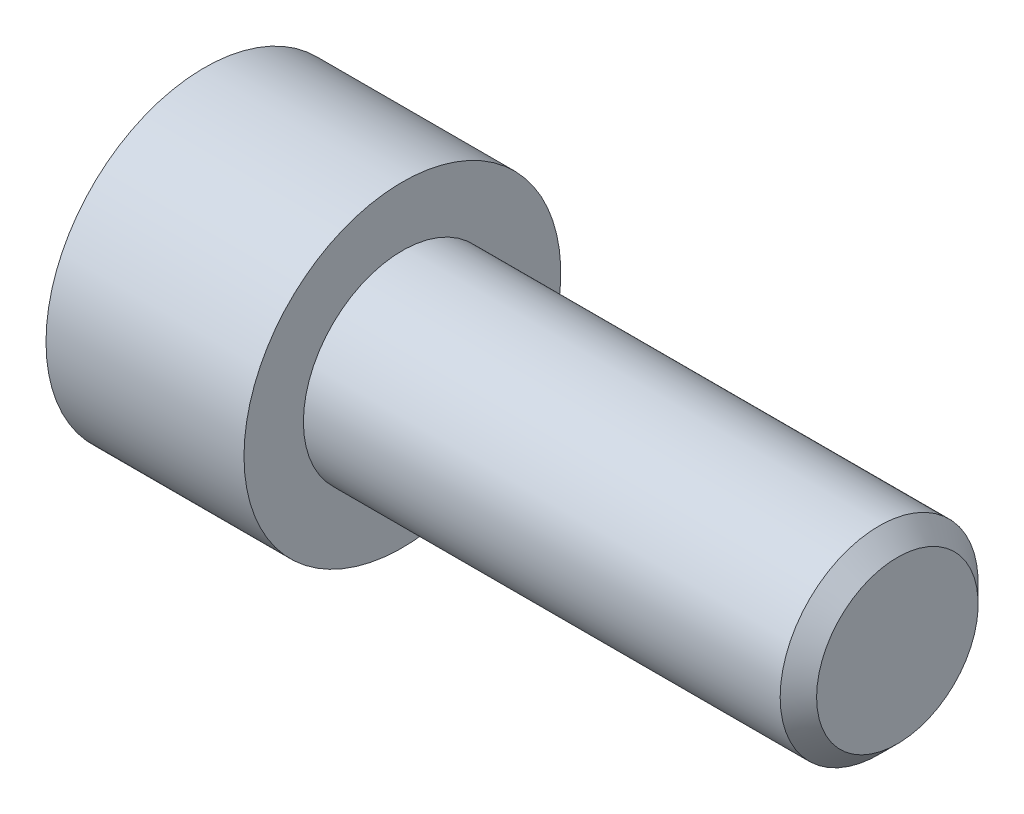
from build123d import *

# Parameters (mm, degrees)
ENL_V_MAT_EXTRU_1_DEPTH = 5


with BuildPart() as part:
    # Esquisse1 → R_volution1 (revolve)
    with BuildSketch(Plane.XY, mode=Mode.PRIVATE) as r_volution1_sk:
        Polygon((-10, 0), (-10, 8), (0, 8), (0, 5), (24.08, 5), (25, 4.08), (25, 0), align=None)
    revolve(r_volution1_sk.sketch.rotate(Axis((25, 0, 0), (-1, 0, 0)), 270), axis=Axis((25, 0, 0), (-1, 0, 0)))

    # Esquisse2 → Enl_v. mat.-Extru.1 (cut)
    with BuildSketch(Plane(origin=(-10, 0, 0), x_dir=(0, 0, -1), z_dir=(1, 0, 0))):
        Polygon((-4, 2.309401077), (-4, -2.309401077), (0, -4.618802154), (4, -2.309401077), (4, 2.309401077), (0, 4.618802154), align=None)
    extrude(amount=ENL_V_MAT_EXTRU_1_DEPTH, mode=Mode.SUBTRACT)

    # Esquisse3 → Enl_vement de mati_re-R_volution1 (revolve, cut)
    with BuildSketch(Plane.XY, mode=Mode.PRIVATE) as enl_vement_de_mati_re_r_volution1_sk:
        Polygon((-5, 0), (-5, 3.99), (-2.696372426, 0), align=None)
    revolve(enl_vement_de_mati_re_r_volution1_sk.sketch.rotate(Axis((-2.696372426, 0, 0), (-1, 0, 0)), 270), axis=Axis((-2.696372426, 0, 0), (-1, 0, 0)), mode=Mode.SUBTRACT)


solid = part.part
